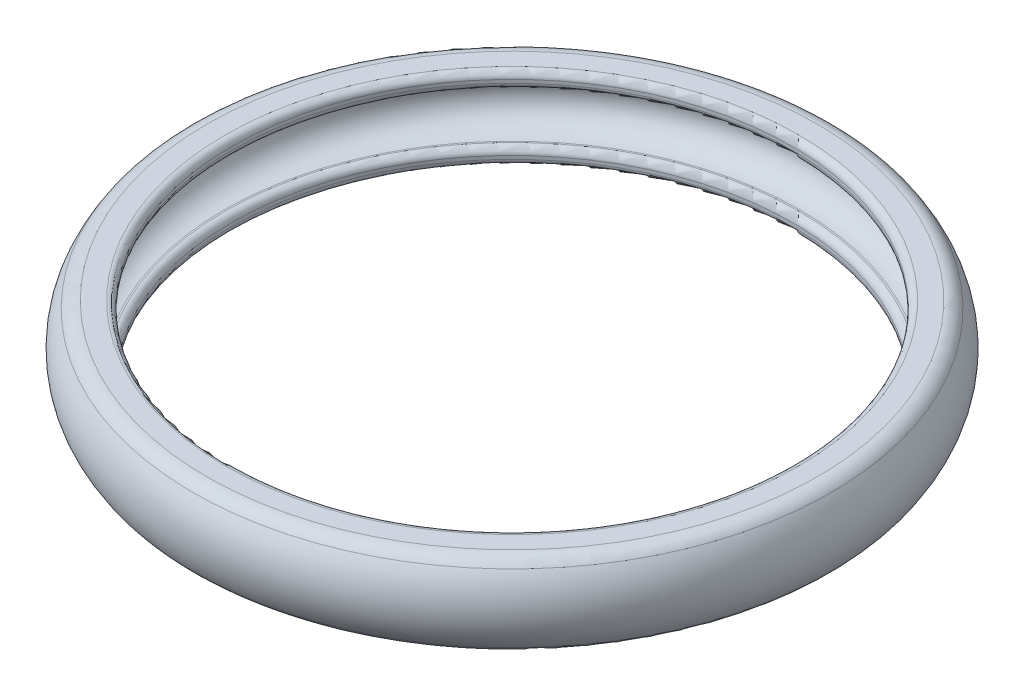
from build123d import *


with BuildPart() as part:
    # Sketch 1 → Revolve 1 (revolve)
    with BuildSketch(Plane.XY, mode=Mode.PRIVATE) as revolve_1_sk:
        with BuildLine():
            Line((17.4, 0), (18.529210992, 0))
            ThreePointArc((18.529210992, 0), (18.992121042, 0.11359474), (19.349862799, 0.428571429))
            ThreePointArc((19.349862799, 0.428571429), (20, 2.5), (19.349862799, 4.571428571))
            ThreePointArc((19.349862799, 4.571428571), (18.992121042, 4.88640526), (18.529210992, 5))
            Line((18.529210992, 5), (17.4, 5))
            ThreePointArc((17.4, 5), (17.117157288, 4.882842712), (17, 4.6))
            Line((17, 4.6), (17, 4.4))
            ThreePointArc((17, 4.4), (17.117157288, 4.117157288), (17.4, 4))
            Line((17.4, 4), (17.5, 4))
            ThreePointArc((17.5, 4), (19, 2.5), (17.5, 1))
            Line((17.5, 1), (17.4, 1))
            ThreePointArc((17.4, 1), (17.117157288, 0.882842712), (17, 0.6))
            Line((17, 0.6), (17, 0.4))
            ThreePointArc((17, 0.4), (17.117157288, 0.117157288), (17.4, 0))
        make_face()
    revolve(revolve_1_sk.sketch.rotate(Axis((0, 18.523809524, 0), (0, -1, 0)), 180), axis=Axis((0, 18.523809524, 0), (0, -1, 0)))


solid = part.part
